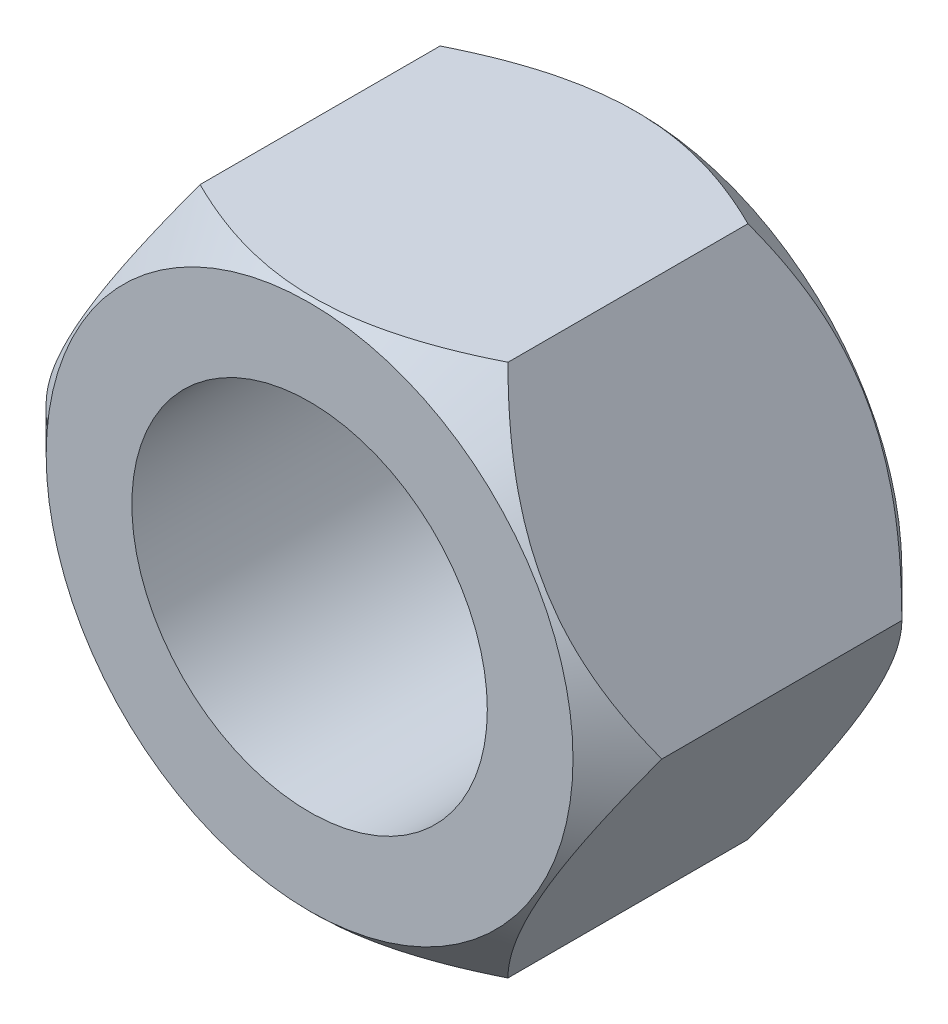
ISO-10303-21;
HEADER;
FILE_DESCRIPTION(('STEP AP214'),'2;1');
FILE_NAME('part.step','',(''),(''),'','','');
FILE_SCHEMA(('AUTOMOTIVE_DESIGN { 1 0 10303 214 1 1 1 1 }'));
ENDSEC;
DATA;
#1=APPLICATION_CONTEXT('core data for automotive mechanical design processes');
#2=APPLICATION_PROTOCOL_DEFINITION('international standard','automotive_design',2000,#1);
#3=PRODUCT_CONTEXT('',#1,'mechanical');
#4=PRODUCT('Part','Part','',(#3));
#5=PRODUCT_RELATED_PRODUCT_CATEGORY('part','',(#4));
#6=PRODUCT_DEFINITION_FORMATION('','',#4);
#7=PRODUCT_DEFINITION_CONTEXT('part definition',#1,'design');
#8=PRODUCT_DEFINITION('design','',#6,#7);
#9=PRODUCT_DEFINITION_SHAPE('','',#8);
#10=(LENGTH_UNIT() NAMED_UNIT(*) SI_UNIT(.MILLI.,.METRE.));
#11=(NAMED_UNIT(*) PLANE_ANGLE_UNIT() SI_UNIT($,.RADIAN.));
#12=(NAMED_UNIT(*) SI_UNIT($,.STERADIAN.) SOLID_ANGLE_UNIT());
#13=UNCERTAINTY_MEASURE_WITH_UNIT(LENGTH_MEASURE(1.E-05),#10,'distance_accuracy_value','');
#14=(GEOMETRIC_REPRESENTATION_CONTEXT(3) GLOBAL_UNCERTAINTY_ASSIGNED_CONTEXT((#13)) GLOBAL_UNIT_ASSIGNED_CONTEXT((#10,
#11,#12)) REPRESENTATION_CONTEXT('',''));
#15=CARTESIAN_POINT('',(0.,0.,0.));
#16=DIRECTION('',(0.,0.,1.));
#17=DIRECTION('',(1.,0.,0.));
#18=AXIS2_PLACEMENT_3D('',#15,#16,#17);
#19=CARTESIAN_POINT('',(0.,0.,7.4));
#20=DIRECTION('',(0.,0.,1.));
#21=DIRECTION('',(1.,0.,0.));
#22=AXIS2_PLACEMENT_3D('',#19,#20,#21);
#23=PLANE('',#22);
#24=CARTESIAN_POINT('',(0.,0.,7.4));
#25=DIRECTION('',(0.,0.,1.));
#26=DIRECTION('',(1.,0.,0.));
#27=AXIS2_PLACEMENT_3D('',#24,#25,#26);
#28=CIRCLE('',#27,8.);
#29=CARTESIAN_POINT('',(8.,0.,7.4));
#30=VERTEX_POINT('',#29);
#31=EDGE_CURVE('E105',#30,#30,#28,.T.);
#32=ORIENTED_EDGE('',*,*,#31,.F.);
#33=EDGE_LOOP('',(#32));
#34=FACE_BOUND('',#33,.T.);
#35=CARTESIAN_POINT('',(0.,0.,7.4));
#36=DIRECTION('',(0.,0.,1.));
#37=DIRECTION('',(1.,0.,0.));
#38=AXIS2_PLACEMENT_3D('',#35,#36,#37);
#39=CIRCLE('',#38,11.856406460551);
#40=CARTESIAN_POINT('',(11.856406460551,0.,7.4));
#41=VERTEX_POINT('',#40);
#42=EDGE_CURVE('E220',#41,#41,#39,.T.);
#43=ORIENTED_EDGE('',*,*,#42,.T.);
#44=EDGE_LOOP('',(#43));
#45=FACE_BOUND('',#44,.T.);
#46=ADVANCED_FACE('F33',(#34,#45),#23,.T.);
#47=CARTESIAN_POINT('',(0.,0.,-7.4));
#48=DIRECTION('',(0.,0.,1.));
#49=DIRECTION('',(1.,0.,0.));
#50=AXIS2_PLACEMENT_3D('',#47,#48,#49);
#51=PLANE('',#50);
#52=CARTESIAN_POINT('',(0.,0.,-7.4));
#53=DIRECTION('',(0.,0.,1.));
#54=DIRECTION('',(1.,0.,0.));
#55=AXIS2_PLACEMENT_3D('',#52,#53,#54);
#56=CIRCLE('',#55,8.);
#57=CARTESIAN_POINT('',(8.,0.,-7.4));
#58=VERTEX_POINT('',#57);
#59=EDGE_CURVE('E109',#58,#58,#56,.T.);
#60=ORIENTED_EDGE('',*,*,#59,.T.);
#61=EDGE_LOOP('',(#60));
#62=FACE_BOUND('',#61,.T.);
#63=CARTESIAN_POINT('',(0.,0.,-7.4));
#64=DIRECTION('',(0.,0.,1.));
#65=DIRECTION('',(1.,0.,0.));
#66=AXIS2_PLACEMENT_3D('',#63,#64,#65);
#67=CIRCLE('',#66,11.856406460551);
#68=CARTESIAN_POINT('',(11.856406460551,0.,-7.4));
#69=VERTEX_POINT('',#68);
#70=EDGE_CURVE('E92',#69,#69,#67,.T.);
#71=ORIENTED_EDGE('',*,*,#70,.F.);
#72=EDGE_LOOP('',(#71));
#73=FACE_BOUND('',#72,.T.);
#74=ADVANCED_FACE('F208',(#62,#73),#51,.F.);
#75=CARTESIAN_POINT('',(6.92820323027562,-11.9999999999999,7.4));
#76=DIRECTION('',(-0.866025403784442,0.499999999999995,0.));
#77=DIRECTION('',(-0.499999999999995,-0.866025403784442,0.));
#78=AXIS2_PLACEMENT_3D('',#75,#76,#77);
#79=PLANE('',#78);
#80=DIRECTION('',(0.,0.,-1.));
#81=VECTOR('',#80,1.);
#82=CARTESIAN_POINT('',(13.856406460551,0.,7.4));
#83=LINE('',#82,#81);
#84=CARTESIAN_POINT('',(13.856406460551,0.,5.4));
#85=VERTEX_POINT('',#84);
#86=CARTESIAN_POINT('',(13.856406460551,0.,-5.4));
#87=VERTEX_POINT('',#86);
#88=EDGE_CURVE('E11',#85,#87,#83,.T.);
#89=ORIENTED_EDGE('',*,*,#88,.F.);
#90=CARTESIAN_POINT('',(13.8565219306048,0.0002,5.3998845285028));
#91=CARTESIAN_POINT('',(13.7374109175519,-0.206106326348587,5.51897795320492));
#92=CARTESIAN_POINT('',(13.6173670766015,-0.414028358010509,5.63443727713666));
#93=CARTESIAN_POINT('',(13.3752685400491,-0.833355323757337,5.85693335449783));
#94=CARTESIAN_POINT('',(13.2532127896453,-1.04476208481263,5.96396550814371));
#95=CARTESIAN_POINT('',(13.006369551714,-1.47230711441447,6.16890615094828));
#96=CARTESIAN_POINT('',(12.8815704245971,-1.6884655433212,6.26675889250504));
#97=CARTESIAN_POINT('',(12.6299224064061,-2.12433269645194,6.45121545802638));
#98=CARTESIAN_POINT('',(12.5030738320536,-2.3440408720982,6.53782100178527));
#99=CARTESIAN_POINT('',(12.2493664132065,-2.78347501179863,6.69704298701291));
#100=CARTESIAN_POINT('',(12.1225387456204,-3.0031469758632,6.76985699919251));
#101=CARTESIAN_POINT('',(11.8671055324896,-3.4455702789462,6.90168005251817));
#102=CARTESIAN_POINT('',(11.7385001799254,-3.66832128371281,6.960690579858));
#103=CARTESIAN_POINT('',(11.480061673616,-4.11594990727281,7.06342102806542));
#104=CARTESIAN_POINT('',(11.3502319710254,-4.34082154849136,7.10717536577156));
#105=CARTESIAN_POINT('',(11.0894826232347,-4.79245266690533,7.17843200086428));
#106=CARTESIAN_POINT('',(10.9585631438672,-5.01921185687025,7.20593672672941));
#107=CARTESIAN_POINT('',(10.6395223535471,-5.57180671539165,7.25205450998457));
#108=CARTESIAN_POINT('',(10.4510562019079,-5.89823966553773,7.2617321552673));
#109=CARTESIAN_POINT('',(10.0744647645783,-6.55051516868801,7.24548750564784));
#110=CARTESIAN_POINT('',(9.88633962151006,-6.87635747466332,7.21955273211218));
#111=CARTESIAN_POINT('',(9.5118627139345,-7.52497050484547,7.13361406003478));
#112=CARTESIAN_POINT('',(9.32551316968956,-7.84773738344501,7.07357206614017));
#113=CARTESIAN_POINT('',(8.95601707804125,-8.48772338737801,6.92268263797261));
#114=CARTESIAN_POINT('',(8.77287028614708,-8.80494293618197,6.83183756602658));
#115=CARTESIAN_POINT('',(8.44776278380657,-9.36804564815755,6.6449480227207));
#116=CARTESIAN_POINT('',(8.30508197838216,-9.6151760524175,6.55382004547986));
#117=CARTESIAN_POINT('',(8.02228146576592,-10.1050009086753,6.35688014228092));
#118=CARTESIAN_POINT('',(7.88216183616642,-10.3476952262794,6.25106777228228));
#119=CARTESIAN_POINT('',(7.60492501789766,-10.8278834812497,6.02713074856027));
#120=CARTESIAN_POINT('',(7.46779994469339,-11.065391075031,5.9090448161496));
#121=CARTESIAN_POINT('',(7.19608877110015,-11.5360086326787,5.66211075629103));
#122=CARTESIAN_POINT('',(7.06150117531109,-11.7691211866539,5.53326922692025));
#123=CARTESIAN_POINT('',(6.92808776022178,-12.0001999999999,5.3998845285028));
#124=B_SPLINE_CURVE_WITH_KNOTS('',3,(#90,#91,#92,#93,#94,#95,#96,#97,#98,#99,#100,#101,#102,
#103,#104,#105,#106,#107,#108,#109,#110,#111,#112,#113,#114,#115,#116,#117,#118,#119,#120,#121,
#122,#123),.UNSPECIFIED.,.F.,.F.,(4,2,2,2,2,2,2,2,2,2,2,2,2,2,2,2,4),(0.,0.79903119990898,
1.59849555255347,2.40253734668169,3.20645605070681,3.99780391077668,4.7890665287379,
5.57853238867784,6.36788023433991,7.49728680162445,8.62708921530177,9.75815602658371,
10.8891361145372,11.7873913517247,12.6856737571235,13.5812036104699,14.4761880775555),.UNSPECIFIED.);
#125=CARTESIAN_POINT('',(6.92820323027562,-11.9999999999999,5.4));
#126=VERTEX_POINT('',#125);
#127=EDGE_CURVE('E85',#85,#126,#124,.T.);
#128=ORIENTED_EDGE('',*,*,#127,.T.);
#129=DIRECTION('',(0.,0.,-1.));
#130=VECTOR('',#129,1.);
#131=CARTESIAN_POINT('',(6.92820323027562,-11.9999999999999,7.4));
#132=LINE('',#131,#130);
#133=CARTESIAN_POINT('',(6.92820323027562,-11.9999999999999,-5.4));
#134=VERTEX_POINT('',#133);
#135=EDGE_CURVE('E57',#126,#134,#132,.T.);
#136=ORIENTED_EDGE('',*,*,#135,.T.);
#137=CARTESIAN_POINT('',(6.92808776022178,-12.0001999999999,-5.3998845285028));
#138=CARTESIAN_POINT('',(7.04719877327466,-11.7938936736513,-5.51897795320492));
#139=CARTESIAN_POINT('',(7.16724261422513,-11.5859716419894,-5.63443727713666));
#140=CARTESIAN_POINT('',(7.40934115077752,-11.1666446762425,-5.85693335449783));
#141=CARTESIAN_POINT('',(7.5313969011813,-10.9552379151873,-5.96396550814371));
#142=CARTESIAN_POINT('',(7.77824013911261,-10.5276928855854,-6.16890615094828));
#143=CARTESIAN_POINT('',(7.90303926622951,-10.3115344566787,-6.26675889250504));
#144=CARTESIAN_POINT('',(8.15468728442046,-9.87566730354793,-6.45121545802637));
#145=CARTESIAN_POINT('',(8.28153585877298,-9.65595912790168,-6.53782100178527));
#146=CARTESIAN_POINT('',(8.53524327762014,-9.21652498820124,-6.69704298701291));
#147=CARTESIAN_POINT('',(8.66207094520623,-8.99685302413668,-6.76985699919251));
#148=CARTESIAN_POINT('',(8.91750415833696,-8.55442972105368,-6.90168005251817));
#149=CARTESIAN_POINT('',(9.04610951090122,-8.33167871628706,-6.960690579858));
#150=CARTESIAN_POINT('',(9.30454801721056,-7.88405009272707,-7.06342102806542));
#151=CARTESIAN_POINT('',(9.4343777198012,-7.65917845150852,-7.10717536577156));
#152=CARTESIAN_POINT('',(9.69512706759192,-7.20754733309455,-7.17843200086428));
#153=CARTESIAN_POINT('',(9.82604654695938,-6.98078814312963,-7.20593672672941));
#154=CARTESIAN_POINT('',(10.1450873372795,-6.42819328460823,-7.25205450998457));
#155=CARTESIAN_POINT('',(10.3335534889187,-6.10176033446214,-7.2617321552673));
#156=CARTESIAN_POINT('',(10.7101449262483,-5.44948483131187,-7.24548750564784));
#157=CARTESIAN_POINT('',(10.8982700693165,-5.12364252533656,-7.21955273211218));
#158=CARTESIAN_POINT('',(11.2727469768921,-4.47502949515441,-7.13361406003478));
#159=CARTESIAN_POINT('',(11.459096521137,-4.15226261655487,-7.07357206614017));
#160=CARTESIAN_POINT('',(11.8285926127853,-3.51227661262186,-6.92268263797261));
#161=CARTESIAN_POINT('',(12.0117394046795,-3.19505706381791,-6.83183756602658));
#162=CARTESIAN_POINT('',(12.33684690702,-2.63195435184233,-6.6449480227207));
#163=CARTESIAN_POINT('',(12.4795277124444,-2.38482394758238,-6.55382004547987));
#164=CARTESIAN_POINT('',(12.7623282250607,-1.89499909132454,-6.35688014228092));
#165=CARTESIAN_POINT('',(12.9024478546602,-1.65230477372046,-6.25106777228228));
#166=CARTESIAN_POINT('',(13.1796846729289,-1.17211651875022,-6.02713074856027));
#167=CARTESIAN_POINT('',(13.3168097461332,-0.934608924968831,-5.9090448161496));
#168=CARTESIAN_POINT('',(13.5885209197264,-0.463991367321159,-5.66211075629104));
#169=CARTESIAN_POINT('',(13.7231085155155,-0.23087881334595,-5.53326922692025));
#170=CARTESIAN_POINT('',(13.8565219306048,0.000200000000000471,-5.3998845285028));
#171=B_SPLINE_CURVE_WITH_KNOTS('',3,(#137,#138,#139,#140,#141,#142,#143,#144,#145,#146,#147,
#148,#149,#150,#151,#152,#153,#154,#155,#156,#157,#158,#159,#160,#161,#162,#163,#164,#165,#166,
#167,#168,#169,#170),.UNSPECIFIED.,.F.,.F.,(4,2,2,2,2,2,2,2,2,2,2,2,2,2,2,2,4),(0.,
0.799031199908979,1.59849555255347,2.40253734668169,3.2064560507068,3.99780391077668,
4.7890665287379,5.57853238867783,6.36788023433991,7.49728680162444,8.62708921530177,
9.75815602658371,10.8891361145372,11.7873913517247,12.6856737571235,13.5812036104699,
14.4761880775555),.UNSPECIFIED.);
#172=EDGE_CURVE('E101',#134,#87,#171,.T.);
#173=ORIENTED_EDGE('',*,*,#172,.T.);
#174=EDGE_LOOP('',(#89,#128,#136,#173));
#175=FACE_BOUND('',#174,.T.);
#176=ADVANCED_FACE('F35',(#175),#79,.F.);
#177=CARTESIAN_POINT('',(13.856406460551,0.,7.4));
#178=DIRECTION('',(-0.866025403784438,-0.500000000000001,0.));
#179=DIRECTION('',(0.500000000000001,-0.866025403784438,0.));
#180=AXIS2_PLACEMENT_3D('',#177,#178,#179);
#181=PLANE('',#180);
#182=DIRECTION('',(0.,0.,-1.));
#183=VECTOR('',#182,1.);
#184=CARTESIAN_POINT('',(6.92820323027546,12.,7.4));
#185=LINE('',#184,#183);
#186=CARTESIAN_POINT('',(6.92820323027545,12.,5.4));
#187=VERTEX_POINT('',#186);
#188=CARTESIAN_POINT('',(6.92820323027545,12.,-5.4));
#189=VERTEX_POINT('',#188);
#190=EDGE_CURVE('E42',#187,#189,#185,.T.);
#191=ORIENTED_EDGE('',*,*,#190,.F.);
#192=CARTESIAN_POINT('',(6.92808776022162,12.0002,5.3998845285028));
#193=CARTESIAN_POINT('',(7.0471987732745,11.7938936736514,5.51897795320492));
#194=CARTESIAN_POINT('',(7.16724261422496,11.5859716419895,5.63443727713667));
#195=CARTESIAN_POINT('',(7.40934115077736,11.1666446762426,5.85693335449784));
#196=CARTESIAN_POINT('',(7.53139690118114,10.9552379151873,5.96396550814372));
#197=CARTESIAN_POINT('',(7.77824013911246,10.5276928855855,6.1689061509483));
#198=CARTESIAN_POINT('',(7.90303926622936,10.3115344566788,6.26675889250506));
#199=CARTESIAN_POINT('',(8.15468728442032,9.87566730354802,6.4512154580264));
#200=CARTESIAN_POINT('',(8.28153585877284,9.65595912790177,6.5378210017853));
#201=CARTESIAN_POINT('',(8.53524327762,9.21652498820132,6.69704298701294));
#202=CARTESIAN_POINT('',(8.6620709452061,8.99685302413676,6.76985699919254));
#203=CARTESIAN_POINT('',(8.91750415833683,8.55442972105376,6.90168005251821));
#204=CARTESIAN_POINT('',(9.0461095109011,8.33167871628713,6.96069057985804));
#205=CARTESIAN_POINT('',(9.30454801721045,7.88405009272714,7.06342102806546));
#206=CARTESIAN_POINT('',(9.43437771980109,7.65917845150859,7.1071753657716));
#207=CARTESIAN_POINT('',(9.69512706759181,7.20754733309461,7.17843200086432));
#208=CARTESIAN_POINT('',(9.82604654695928,6.98078814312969,7.20593672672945));
#209=CARTESIAN_POINT('',(10.1450873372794,6.42819328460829,7.25205450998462));
#210=CARTESIAN_POINT('',(10.3335534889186,6.10176033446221,7.26173215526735));
#211=CARTESIAN_POINT('',(10.7101449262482,5.44948483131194,7.24548750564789));
#212=CARTESIAN_POINT('',(10.8982700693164,5.12364252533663,7.21955273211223));
#213=CARTESIAN_POINT('',(11.272746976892,4.47502949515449,7.13361406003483));
#214=CARTESIAN_POINT('',(11.4590965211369,4.15226261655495,7.07357206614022));
#215=CARTESIAN_POINT('',(11.8285926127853,3.51227661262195,6.92268263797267));
#216=CARTESIAN_POINT('',(12.0117394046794,3.19505706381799,6.83183756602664));
#217=CARTESIAN_POINT('',(12.3368469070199,2.63195435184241,6.64494802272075));
#218=CARTESIAN_POINT('',(12.4795277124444,2.38482394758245,6.55382004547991));
#219=CARTESIAN_POINT('',(12.7623282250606,1.89499909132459,6.35688014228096));
#220=CARTESIAN_POINT('',(12.9024478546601,1.65230477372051,6.25106777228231));
#221=CARTESIAN_POINT('',(13.1796846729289,1.17211651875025,6.0271307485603));
#222=CARTESIAN_POINT('',(13.3168097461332,0.934608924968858,5.90904481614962));
#223=CARTESIAN_POINT('',(13.5885209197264,0.463991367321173,5.66211075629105));
#224=CARTESIAN_POINT('',(13.7231085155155,0.230878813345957,5.53326922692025));
#225=CARTESIAN_POINT('',(13.8565219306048,-0.000200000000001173,5.3998845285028));
#226=B_SPLINE_CURVE_WITH_KNOTS('',3,(#192,#193,#194,#195,#196,#197,#198,#199,#200,#201,#202,
#203,#204,#205,#206,#207,#208,#209,#210,#211,#212,#213,#214,#215,#216,#217,#218,#219,#220,#221,
#222,#223,#224,#225),.UNSPECIFIED.,.F.,.F.,(4,2,2,2,2,2,2,2,2,2,2,2,2,2,2,2,4),(0.,
0.799031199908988,1.59849555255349,2.40253734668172,3.20645605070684,3.99780391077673,
4.78906652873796,5.57853238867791,6.36788023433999,7.49728680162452,8.62708921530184,
9.75815602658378,10.8891361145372,11.7873913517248,12.6856737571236,13.58120361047,
14.4761880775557),.UNSPECIFIED.);
#227=EDGE_CURVE('E88',#187,#85,#226,.T.);
#228=ORIENTED_EDGE('',*,*,#227,.T.);
#229=ORIENTED_EDGE('',*,*,#88,.T.);
#230=CARTESIAN_POINT('',(13.8565219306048,-0.0002,-5.3998845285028));
#231=CARTESIAN_POINT('',(13.7374109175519,0.206106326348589,-5.51897795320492));
#232=CARTESIAN_POINT('',(13.6173670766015,0.414028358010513,-5.63443727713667));
#233=CARTESIAN_POINT('',(13.3752685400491,0.833355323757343,-5.85693335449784));
#234=CARTESIAN_POINT('',(13.2532127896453,1.04476208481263,-5.96396550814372));
#235=CARTESIAN_POINT('',(13.006369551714,1.47230711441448,-6.1689061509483));
#236=CARTESIAN_POINT('',(12.8815704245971,1.68846554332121,-6.26675889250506));
#237=CARTESIAN_POINT('',(12.6299224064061,2.12433269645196,-6.4512154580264));
#238=CARTESIAN_POINT('',(12.5030738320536,2.34404087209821,-6.5378210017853));
#239=CARTESIAN_POINT('',(12.2493664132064,2.78347501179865,-6.69704298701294));
#240=CARTESIAN_POINT('',(12.1225387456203,3.00314697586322,-6.76985699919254));
#241=CARTESIAN_POINT('',(11.8671055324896,3.44557027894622,-6.90168005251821));
#242=CARTESIAN_POINT('',(11.7385001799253,3.66832128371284,-6.96069057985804));
#243=CARTESIAN_POINT('',(11.480061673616,4.11594990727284,-7.06342102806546));
#244=CARTESIAN_POINT('',(11.3502319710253,4.34082154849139,-7.1071753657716));
#245=CARTESIAN_POINT('',(11.0894826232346,4.79245266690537,-7.17843200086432));
#246=CARTESIAN_POINT('',(10.9585631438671,5.01921185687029,-7.20593672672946));
#247=CARTESIAN_POINT('',(10.639522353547,5.57180671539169,-7.25205450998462));
#248=CARTESIAN_POINT('',(10.4510562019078,5.89823966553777,-7.26173215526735));
#249=CARTESIAN_POINT('',(10.0744647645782,6.55051516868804,-7.24548750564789));
#250=CARTESIAN_POINT('',(9.88633962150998,6.87635747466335,-7.21955273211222));
#251=CARTESIAN_POINT('',(9.51186271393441,7.5249705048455,-7.13361406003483));
#252=CARTESIAN_POINT('',(9.32551316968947,7.84773738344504,-7.07357206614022));
#253=CARTESIAN_POINT('',(8.95601707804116,8.48772338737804,-6.92268263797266));
#254=CARTESIAN_POINT('',(8.77287028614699,8.80494293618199,-6.83183756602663));
#255=CARTESIAN_POINT('',(8.44776278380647,9.36804564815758,-6.64494802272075));
#256=CARTESIAN_POINT('',(8.30508197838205,9.61517605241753,-6.55382004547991));
#257=CARTESIAN_POINT('',(8.0222814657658,10.1050009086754,-6.35688014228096));
#258=CARTESIAN_POINT('',(7.88216183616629,10.3476952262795,-6.25106777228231));
#259=CARTESIAN_POINT('',(7.60492501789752,10.8278834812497,-6.0271307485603));
#260=CARTESIAN_POINT('',(7.46779994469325,11.0653910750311,-5.90904481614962));
#261=CARTESIAN_POINT('',(7.1960887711,11.5360086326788,-5.66211075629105));
#262=CARTESIAN_POINT('',(7.06150117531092,11.769121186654,-5.53326922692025));
#263=CARTESIAN_POINT('',(6.92808776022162,12.0002,-5.3998845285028));
#264=B_SPLINE_CURVE_WITH_KNOTS('',3,(#230,#231,#232,#233,#234,#235,#236,#237,#238,#239,#240,
#241,#242,#243,#244,#245,#246,#247,#248,#249,#250,#251,#252,#253,#254,#255,#256,#257,#258,#259,
#260,#261,#262,#263),.UNSPECIFIED.,.F.,.F.,(4,2,2,2,2,2,2,2,2,2,2,2,2,2,2,2,4),(0.,
0.79903119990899,1.59849555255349,2.40253734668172,3.20645605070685,3.99780391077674,
4.78906652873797,5.57853238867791,6.36788023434,7.49728680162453,8.62708921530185,
9.75815602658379,10.8891361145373,11.7873913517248,12.6856737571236,13.58120361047,
14.4761880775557),.UNSPECIFIED.);
#265=EDGE_CURVE('E106',#87,#189,#264,.T.);
#266=ORIENTED_EDGE('',*,*,#265,.T.);
#267=EDGE_LOOP('',(#191,#228,#229,#266));
#268=FACE_BOUND('',#267,.T.);
#269=ADVANCED_FACE('F96',(#268),#181,.F.);
#270=CARTESIAN_POINT('',(6.92820323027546,12.,7.4));
#271=DIRECTION('',(0.,-1.,0.));
#272=DIRECTION('',(1.,0.,0.));
#273=AXIS2_PLACEMENT_3D('',#270,#271,#272);
#274=PLANE('',#273);
#275=DIRECTION('',(0.,0.,-1.));
#276=VECTOR('',#275,1.);
#277=CARTESIAN_POINT('',(-6.92820323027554,11.9999999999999,7.4));
#278=LINE('',#277,#276);
#279=CARTESIAN_POINT('',(-6.92820323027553,11.9999999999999,5.4));
#280=VERTEX_POINT('',#279);
#281=CARTESIAN_POINT('',(-6.92820323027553,11.9999999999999,-5.4));
#282=VERTEX_POINT('',#281);
#283=EDGE_CURVE('E198',#280,#282,#278,.T.);
#284=ORIENTED_EDGE('',*,*,#283,.F.);
#285=CARTESIAN_POINT('',(-14.4006888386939,11.9999999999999,0.511278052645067));
#286=CARTESIAN_POINT('',(-14.0525506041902,11.9999999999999,0.778670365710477));
#287=CARTESIAN_POINT('',(-13.702529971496,11.9999999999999,1.04365047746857));
#288=CARTESIAN_POINT('',(-12.9979568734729,11.9999999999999,1.56768618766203));
#289=CARTESIAN_POINT('',(-12.6434033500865,11.9999999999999,1.82674036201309));
#290=CARTESIAN_POINT('',(-11.9264058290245,11.9999999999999,2.33966777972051));
#291=CARTESIAN_POINT('',(-11.563922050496,11.9999999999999,2.59348559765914));
#292=CARTESIAN_POINT('',(-10.8329104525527,11.9999999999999,3.09223323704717));
#293=CARTESIAN_POINT('',(-10.4643830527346,11.9999999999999,3.33716367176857));
#294=CARTESIAN_POINT('',(-9.69689227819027,11.9999999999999,3.83116495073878));
#295=CARTESIAN_POINT('',(-9.29747155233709,11.9999999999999,4.07952881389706));
#296=CARTESIAN_POINT('',(-8.48925422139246,11.9999999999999,4.56076138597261));
#297=CARTESIAN_POINT('',(-8.08045606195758,11.9999999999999,4.79362750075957));
#298=CARTESIAN_POINT('',(-7.25338535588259,11.9999999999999,5.2388994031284));
#299=CARTESIAN_POINT('',(-6.83514540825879,11.9999999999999,5.45136526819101));
#300=CARTESIAN_POINT('',(-5.98687825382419,11.9999999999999,5.85107663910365));
#301=CARTESIAN_POINT('',(-5.55685670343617,11.9999999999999,6.03833400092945));
#302=CARTESIAN_POINT('',(-4.72649804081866,11.9999999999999,6.36421579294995));
#303=CARTESIAN_POINT('',(-4.32733328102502,11.9999999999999,6.50579700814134));
#304=CARTESIAN_POINT('',(-3.51888368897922,11.9999999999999,6.75700362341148));
#305=CARTESIAN_POINT('',(-3.10959820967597,11.9999999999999,6.86662697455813));
#306=CARTESIAN_POINT('',(-2.29045033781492,11.9999999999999,7.04617663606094));
#307=CARTESIAN_POINT('',(-1.88074784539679,11.9999999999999,7.11682022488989));
#308=CARTESIAN_POINT('',(-1.05631578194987,11.9999999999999,7.21694510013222));
#309=CARTESIAN_POINT('',(-0.641587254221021,11.9999999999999,7.24643478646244));
#310=CARTESIAN_POINT('',(0.170838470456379,11.9999999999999,7.26176834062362));
#311=CARTESIAN_POINT('',(0.568501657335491,12.,7.24943340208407));
#312=CARTESIAN_POINT('',(1.36069882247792,12.,7.18596656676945));
#313=CARTESIAN_POINT('',(1.75523251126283,12.,7.13483112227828));
#314=CARTESIAN_POINT('',(2.54499979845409,12.,6.99577632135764));
#315=CARTESIAN_POINT('',(2.94011749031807,12.,6.90720967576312));
#316=CARTESIAN_POINT('',(3.72166087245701,12.,6.69818886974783));
#317=CARTESIAN_POINT('',(4.10808707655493,12.,6.57773659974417));
#318=CARTESIAN_POINT('',(4.89467698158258,12.,6.30210385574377));
#319=CARTESIAN_POINT('',(5.29425095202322,12.,6.14525929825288));
#320=CARTESIAN_POINT('',(6.0831137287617,12.,5.80734980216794));
#321=CARTESIAN_POINT('',(6.47239778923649,12.,5.62627391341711));
#322=CARTESIAN_POINT('',(7.24252407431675,12.,5.24419683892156));
#323=CARTESIAN_POINT('',(7.62333555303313,12.,5.04313418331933));
#324=CARTESIAN_POINT('',(8.37622961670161,12.,4.62550973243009));
#325=CARTESIAN_POINT('',(8.74831353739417,12.,4.4089503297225));
#326=CARTESIAN_POINT('',(9.46670058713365,12.,3.97436664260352));
#327=CARTESIAN_POINT('',(9.81336920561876,12.,3.75694333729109));
#328=CARTESIAN_POINT('',(10.5007506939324,12.,3.31285021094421));
#329=CARTESIAN_POINT('',(10.8414631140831,12.,3.0861796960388));
#330=CARTESIAN_POINT('',(11.5149702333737,12.,2.62708887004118));
#331=CARTESIAN_POINT('',(11.8478065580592,12.,2.39472940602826));
#332=CARTESIAN_POINT('',(12.5089143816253,12.,1.92378787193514));
#333=CARTESIAN_POINT('',(12.8371871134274,12.,1.6852075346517));
#334=CARTESIAN_POINT('',(13.1635457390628,12.,1.44408105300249));
#335=B_SPLINE_CURVE_WITH_KNOTS('',3,(#285,#286,#287,#288,#289,#290,#291,#292,#293,#294,#295,
#296,#297,#298,#299,#300,#301,#302,#303,#304,#305,#306,#307,#308,#309,#310,#311,#312,#313,#314,
#315,#316,#317,#318,#319,#320,#321,#322,#323,#324,#325,#326,#327,#328,#329,#330,#331,#332,#333,
#334),.UNSPECIFIED.,.F.,.F.,(4,2,2,2,2,2,2,2,2,2,2,2,2,2,2,2,2,2,2,2,2,2,2,2,4),(0.,
1.31694874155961,2.63421070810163,3.96164041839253,5.28897835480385,6.69972456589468,
8.11070632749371,9.51739647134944,10.9234226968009,12.19291615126,13.4624909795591,
14.7078506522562,15.9529560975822,17.1445538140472,18.3362604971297,19.5494774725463,
20.7626225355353,22.0493986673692,23.336758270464,24.6282074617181,25.9194576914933,
27.1469127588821,28.3744600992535,29.5921423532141,30.8094889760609),.UNSPECIFIED.);
#336=EDGE_CURVE('E99',#280,#187,#335,.T.);
#337=ORIENTED_EDGE('',*,*,#336,.T.);
#338=ORIENTED_EDGE('',*,*,#190,.T.);
#339=CARTESIAN_POINT('',(-14.4006888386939,11.9999999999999,-0.511278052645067));
#340=CARTESIAN_POINT('',(-14.0525506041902,11.9999999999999,-0.778670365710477));
#341=CARTESIAN_POINT('',(-13.702529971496,11.9999999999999,-1.04365047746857));
#342=CARTESIAN_POINT('',(-12.9979568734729,11.9999999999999,-1.56768618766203));
#343=CARTESIAN_POINT('',(-12.6434033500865,11.9999999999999,-1.82674036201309));
#344=CARTESIAN_POINT('',(-11.9264058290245,11.9999999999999,-2.33966777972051));
#345=CARTESIAN_POINT('',(-11.563922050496,11.9999999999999,-2.59348559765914));
#346=CARTESIAN_POINT('',(-10.8329104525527,11.9999999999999,-3.09223323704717));
#347=CARTESIAN_POINT('',(-10.4643830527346,11.9999999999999,-3.33716367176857));
#348=CARTESIAN_POINT('',(-9.69689227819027,11.9999999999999,-3.83116495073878));
#349=CARTESIAN_POINT('',(-9.29747155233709,11.9999999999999,-4.07952881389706));
#350=CARTESIAN_POINT('',(-8.48925422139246,11.9999999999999,-4.56076138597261));
#351=CARTESIAN_POINT('',(-8.08045606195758,11.9999999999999,-4.79362750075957));
#352=CARTESIAN_POINT('',(-7.25338535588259,11.9999999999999,-5.2388994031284));
#353=CARTESIAN_POINT('',(-6.83514540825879,11.9999999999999,-5.45136526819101));
#354=CARTESIAN_POINT('',(-5.98687825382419,11.9999999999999,-5.85107663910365));
#355=CARTESIAN_POINT('',(-5.55685670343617,11.9999999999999,-6.03833400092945));
#356=CARTESIAN_POINT('',(-4.72649804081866,11.9999999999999,-6.36421579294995));
#357=CARTESIAN_POINT('',(-4.32733328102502,11.9999999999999,-6.50579700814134));
#358=CARTESIAN_POINT('',(-3.51888368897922,11.9999999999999,-6.75700362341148));
#359=CARTESIAN_POINT('',(-3.10959820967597,11.9999999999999,-6.86662697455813));
#360=CARTESIAN_POINT('',(-2.29045033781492,11.9999999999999,-7.04617663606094));
#361=CARTESIAN_POINT('',(-1.88074784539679,11.9999999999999,-7.11682022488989));
#362=CARTESIAN_POINT('',(-1.05631578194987,11.9999999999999,-7.21694510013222));
#363=CARTESIAN_POINT('',(-0.641587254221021,11.9999999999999,-7.24643478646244));
#364=CARTESIAN_POINT('',(0.170838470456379,11.9999999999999,-7.26176834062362));
#365=CARTESIAN_POINT('',(0.568501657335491,12.,-7.24943340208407));
#366=CARTESIAN_POINT('',(1.36069882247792,12.,-7.18596656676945));
#367=CARTESIAN_POINT('',(1.75523251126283,12.,-7.13483112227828));
#368=CARTESIAN_POINT('',(2.54499979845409,12.,-6.99577632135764));
#369=CARTESIAN_POINT('',(2.94011749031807,12.,-6.90720967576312));
#370=CARTESIAN_POINT('',(3.72166087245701,12.,-6.69818886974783));
#371=CARTESIAN_POINT('',(4.10808707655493,12.,-6.57773659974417));
#372=CARTESIAN_POINT('',(4.89467698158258,12.,-6.30210385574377));
#373=CARTESIAN_POINT('',(5.29425095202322,12.,-6.14525929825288));
#374=CARTESIAN_POINT('',(6.0831137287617,12.,-5.80734980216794));
#375=CARTESIAN_POINT('',(6.47239778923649,12.,-5.62627391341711));
#376=CARTESIAN_POINT('',(7.24252407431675,12.,-5.24419683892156));
#377=CARTESIAN_POINT('',(7.62333555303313,12.,-5.04313418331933));
#378=CARTESIAN_POINT('',(8.37622961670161,12.,-4.62550973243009));
#379=CARTESIAN_POINT('',(8.74831353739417,12.,-4.4089503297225));
#380=CARTESIAN_POINT('',(9.46670058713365,12.,-3.97436664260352));
#381=CARTESIAN_POINT('',(9.81336920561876,12.,-3.75694333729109));
#382=CARTESIAN_POINT('',(10.5007506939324,12.,-3.31285021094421));
#383=CARTESIAN_POINT('',(10.8414631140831,12.,-3.0861796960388));
#384=CARTESIAN_POINT('',(11.5149702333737,12.,-2.62708887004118));
#385=CARTESIAN_POINT('',(11.8478065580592,12.,-2.39472940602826));
#386=CARTESIAN_POINT('',(12.5089143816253,12.,-1.92378787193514));
#387=CARTESIAN_POINT('',(12.8371871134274,12.,-1.6852075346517));
#388=CARTESIAN_POINT('',(13.1635457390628,12.,-1.44408105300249));
#389=B_SPLINE_CURVE_WITH_KNOTS('',3,(#339,#340,#341,#342,#343,#344,#345,#346,#347,#348,#349,
#350,#351,#352,#353,#354,#355,#356,#357,#358,#359,#360,#361,#362,#363,#364,#365,#366,#367,#368,
#369,#370,#371,#372,#373,#374,#375,#376,#377,#378,#379,#380,#381,#382,#383,#384,#385,#386,#387,
#388),.UNSPECIFIED.,.F.,.F.,(4,2,2,2,2,2,2,2,2,2,2,2,2,2,2,2,2,2,2,2,2,2,2,2,4),(0.,
1.31694874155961,2.63421070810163,3.96164041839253,5.28897835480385,6.69972456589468,
8.11070632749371,9.51739647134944,10.9234226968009,12.19291615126,13.4624909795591,
14.7078506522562,15.9529560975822,17.1445538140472,18.3362604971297,19.5494774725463,
20.7626225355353,22.0493986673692,23.336758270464,24.6282074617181,25.9194576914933,
27.1469127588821,28.3744600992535,29.5921423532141,30.8094889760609),.UNSPECIFIED.);
#390=EDGE_CURVE('E111',#189,#282,#389,.F.);
#391=ORIENTED_EDGE('',*,*,#390,.T.);
#392=EDGE_LOOP('',(#284,#337,#338,#391));
#393=FACE_BOUND('',#392,.T.);
#394=ADVANCED_FACE('F160',(#393),#274,.F.);
#395=CARTESIAN_POINT('',(-6.92820323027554,11.9999999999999,7.4));
#396=DIRECTION('',(0.866025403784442,-0.499999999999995,0.));
#397=DIRECTION('',(0.499999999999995,0.866025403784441,0.));
#398=AXIS2_PLACEMENT_3D('',#395,#396,#397);
#399=PLANE('',#398);
#400=DIRECTION('',(0.,0.,-1.));
#401=VECTOR('',#400,1.);
#402=CARTESIAN_POINT('',(-13.856406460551,0.,7.4));
#403=LINE('',#402,#401);
#404=CARTESIAN_POINT('',(-13.856406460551,0.,5.4));
#405=VERTEX_POINT('',#404);
#406=CARTESIAN_POINT('',(-13.856406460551,0.,-5.4));
#407=VERTEX_POINT('',#406);
#408=EDGE_CURVE('E196',#405,#407,#403,.T.);
#409=ORIENTED_EDGE('',*,*,#408,.F.);
#410=CARTESIAN_POINT('',(-13.8565219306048,-0.000200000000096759,5.3998845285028));
#411=CARTESIAN_POINT('',(-13.7374109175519,0.206106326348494,5.51897795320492));
#412=CARTESIAN_POINT('',(-13.6173670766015,0.414028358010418,5.63443727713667));
#413=CARTESIAN_POINT('',(-13.3752685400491,0.833355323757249,5.85693335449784));
#414=CARTESIAN_POINT('',(-13.2532127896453,1.04476208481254,5.96396550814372));
#415=CARTESIAN_POINT('',(-13.006369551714,1.47230711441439,6.1689061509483));
#416=CARTESIAN_POINT('',(-12.8815704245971,1.68846554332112,6.26675889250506));
#417=CARTESIAN_POINT('',(-12.6299224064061,2.12433269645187,6.4512154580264));
#418=CARTESIAN_POINT('',(-12.5030738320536,2.34404087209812,6.5378210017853));
#419=CARTESIAN_POINT('',(-12.2493664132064,2.78347501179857,6.69704298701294));
#420=CARTESIAN_POINT('',(-12.1225387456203,3.00314697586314,6.76985699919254));
#421=CARTESIAN_POINT('',(-11.8671055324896,3.44557027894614,6.90168005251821));
#422=CARTESIAN_POINT('',(-11.7385001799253,3.66832128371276,6.96069057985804));
#423=CARTESIAN_POINT('',(-11.480061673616,4.11594990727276,7.06342102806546));
#424=CARTESIAN_POINT('',(-11.3502319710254,4.34082154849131,7.1071753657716));
#425=CARTESIAN_POINT('',(-11.0894826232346,4.79245266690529,7.17843200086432));
#426=CARTESIAN_POINT('',(-10.9585631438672,5.01921185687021,7.20593672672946));
#427=CARTESIAN_POINT('',(-10.639522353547,5.57180671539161,7.25205450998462));
#428=CARTESIAN_POINT('',(-10.4510562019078,5.8982396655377,7.26173215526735));
#429=CARTESIAN_POINT('',(-10.0744647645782,6.55051516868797,7.24548750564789));
#430=CARTESIAN_POINT('',(-9.88633962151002,6.87635747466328,7.21955273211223));
#431=CARTESIAN_POINT('',(-9.51186271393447,7.52497050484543,7.13361406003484));
#432=CARTESIAN_POINT('',(-9.32551316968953,7.84773738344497,7.07357206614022));
#433=CARTESIAN_POINT('',(-8.95601707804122,8.48772338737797,6.92268263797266));
#434=CARTESIAN_POINT('',(-8.77287028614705,8.80494293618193,6.83183756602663));
#435=CARTESIAN_POINT('',(-8.44776278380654,9.36804564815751,6.64494802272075));
#436=CARTESIAN_POINT('',(-8.30508197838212,9.61517605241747,6.55382004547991));
#437=CARTESIAN_POINT('',(-8.02228146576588,10.1050009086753,6.35688014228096));
#438=CARTESIAN_POINT('',(-7.88216183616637,10.3476952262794,6.25106777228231));
#439=CARTESIAN_POINT('',(-7.6049250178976,10.8278834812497,6.0271307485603));
#440=CARTESIAN_POINT('',(-7.46779994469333,11.0653910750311,5.90904481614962));
#441=CARTESIAN_POINT('',(-7.19608877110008,11.5360086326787,5.66211075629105));
#442=CARTESIAN_POINT('',(-7.06150117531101,11.769121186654,5.53326922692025));
#443=CARTESIAN_POINT('',(-6.9280877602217,12.0001999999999,5.3998845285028));
#444=B_SPLINE_CURVE_WITH_KNOTS('',3,(#410,#411,#412,#413,#414,#415,#416,#417,#418,#419,#420,
#421,#422,#423,#424,#425,#426,#427,#428,#429,#430,#431,#432,#433,#434,#435,#436,#437,#438,#439,
#440,#441,#442,#443),.UNSPECIFIED.,.F.,.F.,(4,2,2,2,2,2,2,2,2,2,2,2,2,2,2,2,4),(0.,
0.799031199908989,1.59849555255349,2.40253734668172,3.20645605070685,3.99780391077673,
4.78906652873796,5.57853238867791,6.36788023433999,7.49728680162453,8.62708921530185,
9.75815602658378,10.8891361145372,11.7873913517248,12.6856737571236,13.58120361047,
14.4761880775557),.UNSPECIFIED.);
#445=EDGE_CURVE('E173',#405,#280,#444,.T.);
#446=ORIENTED_EDGE('',*,*,#445,.T.);
#447=ORIENTED_EDGE('',*,*,#283,.T.);
#448=CARTESIAN_POINT('',(-6.9280877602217,12.0001999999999,-5.3998845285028));
#449=CARTESIAN_POINT('',(-7.04719877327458,11.7938936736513,-5.51897795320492));
#450=CARTESIAN_POINT('',(-7.16724261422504,11.5859716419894,-5.63443727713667));
#451=CARTESIAN_POINT('',(-7.40934115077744,11.1666446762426,-5.85693335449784));
#452=CARTESIAN_POINT('',(-7.53139690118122,10.9552379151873,-5.96396550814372));
#453=CARTESIAN_POINT('',(-7.77824013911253,10.5276928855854,-6.1689061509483));
#454=CARTESIAN_POINT('',(-7.90303926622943,10.3115344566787,-6.26675889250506));
#455=CARTESIAN_POINT('',(-8.15468728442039,9.87566730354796,-6.4512154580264));
#456=CARTESIAN_POINT('',(-8.28153585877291,9.6559591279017,-6.5378210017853));
#457=CARTESIAN_POINT('',(-8.53524327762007,9.21652498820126,-6.69704298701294));
#458=CARTESIAN_POINT('',(-8.66207094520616,8.99685302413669,-6.76985699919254));
#459=CARTESIAN_POINT('',(-8.91750415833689,8.55442972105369,-6.90168005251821));
#460=CARTESIAN_POINT('',(-9.04610951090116,8.33167871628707,-6.96069057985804));
#461=CARTESIAN_POINT('',(-9.3045480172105,7.88405009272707,-7.06342102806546));
#462=CARTESIAN_POINT('',(-9.43437771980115,7.65917845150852,-7.1071753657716));
#463=CARTESIAN_POINT('',(-9.69512706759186,7.20754733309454,-7.17843200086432));
#464=CARTESIAN_POINT('',(-9.82604654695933,6.98078814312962,-7.20593672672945));
#465=CARTESIAN_POINT('',(-10.1450873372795,6.42819328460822,-7.25205450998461));
#466=CARTESIAN_POINT('',(-10.3335534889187,6.10176033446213,-7.26173215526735));
#467=CARTESIAN_POINT('',(-10.7101449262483,5.44948483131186,-7.24548750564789));
#468=CARTESIAN_POINT('',(-10.8982700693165,5.12364252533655,-7.21955273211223));
#469=CARTESIAN_POINT('',(-11.272746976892,4.4750294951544,-7.13361406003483));
#470=CARTESIAN_POINT('',(-11.459096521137,4.15226261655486,-7.07357206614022));
#471=CARTESIAN_POINT('',(-11.8285926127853,3.51227661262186,-6.92268263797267));
#472=CARTESIAN_POINT('',(-12.0117394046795,3.1950570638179,-6.83183756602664));
#473=CARTESIAN_POINT('',(-12.33684690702,2.63195435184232,-6.64494802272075));
#474=CARTESIAN_POINT('',(-12.4795277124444,2.38482394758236,-6.55382004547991));
#475=CARTESIAN_POINT('',(-12.7623282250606,1.8949990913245,-6.35688014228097));
#476=CARTESIAN_POINT('',(-12.9024478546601,1.65230477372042,-6.25106777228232));
#477=CARTESIAN_POINT('',(-13.1796846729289,1.17211651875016,-6.0271307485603));
#478=CARTESIAN_POINT('',(-13.3168097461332,0.934608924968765,-5.90904481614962));
#479=CARTESIAN_POINT('',(-13.5885209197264,0.463991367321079,-5.66211075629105));
#480=CARTESIAN_POINT('',(-13.7231085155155,0.230878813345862,-5.53326922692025));
#481=CARTESIAN_POINT('',(-13.8565219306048,-0.0002000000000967,-5.3998845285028));
#482=B_SPLINE_CURVE_WITH_KNOTS('',3,(#448,#449,#450,#451,#452,#453,#454,#455,#456,#457,#458,
#459,#460,#461,#462,#463,#464,#465,#466,#467,#468,#469,#470,#471,#472,#473,#474,#475,#476,#477,
#478,#479,#480,#481),.UNSPECIFIED.,.F.,.F.,(4,2,2,2,2,2,2,2,2,2,2,2,2,2,2,2,4),(0.,
0.799031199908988,1.59849555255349,2.40253734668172,3.20645605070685,3.99780391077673,
4.78906652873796,5.57853238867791,6.36788023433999,7.49728680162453,8.62708921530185,
9.75815602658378,10.8891361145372,11.7873913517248,12.6856737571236,13.58120361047,
14.4761880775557),.UNSPECIFIED.);
#483=EDGE_CURVE('E150',#282,#407,#482,.T.);
#484=ORIENTED_EDGE('',*,*,#483,.T.);
#485=EDGE_LOOP('',(#409,#446,#447,#484));
#486=FACE_BOUND('',#485,.T.);
#487=ADVANCED_FACE('F163',(#486),#399,.F.);
#488=CARTESIAN_POINT('',(-13.856406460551,0.,7.4));
#489=DIRECTION('',(0.866025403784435,0.500000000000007,0.));
#490=DIRECTION('',(-0.500000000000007,0.866025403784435,0.));
#491=AXIS2_PLACEMENT_3D('',#488,#489,#490);
#492=PLANE('',#491);
#493=DIRECTION('',(0.,0.,-1.));
#494=VECTOR('',#493,1.);
#495=CARTESIAN_POINT('',(-6.92820323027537,-12.,7.4));
#496=LINE('',#495,#494);
#497=CARTESIAN_POINT('',(-6.92820323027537,-12.,5.4));
#498=VERTEX_POINT('',#497);
#499=CARTESIAN_POINT('',(-6.92820323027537,-12.,-5.4));
#500=VERTEX_POINT('',#499);
#501=EDGE_CURVE('E203',#498,#500,#496,.T.);
#502=ORIENTED_EDGE('',*,*,#501,.F.);
#503=CARTESIAN_POINT('',(-6.92808776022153,-12.0002,5.3998845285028));
#504=CARTESIAN_POINT('',(-7.04719877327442,-11.7938936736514,5.51897795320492));
#505=CARTESIAN_POINT('',(-7.16724261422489,-11.5859716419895,5.63443727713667));
#506=CARTESIAN_POINT('',(-7.40934115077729,-11.1666446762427,5.85693335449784));
#507=CARTESIAN_POINT('',(-7.53139690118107,-10.9552379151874,5.96396550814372));
#508=CARTESIAN_POINT('',(-7.77824013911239,-10.5276928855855,6.1689061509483));
#509=CARTESIAN_POINT('',(-7.90303926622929,-10.3115344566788,6.26675889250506));
#510=CARTESIAN_POINT('',(-8.15468728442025,-9.87566730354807,6.4512154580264));
#511=CARTESIAN_POINT('',(-8.28153585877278,-9.65595912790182,6.5378210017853));
#512=CARTESIAN_POINT('',(-8.53524327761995,-9.21652498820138,6.69704298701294));
#513=CARTESIAN_POINT('',(-8.66207094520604,-8.99685302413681,6.76985699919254));
#514=CARTESIAN_POINT('',(-8.91750415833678,-8.55442972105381,6.90168005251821));
#515=CARTESIAN_POINT('',(-9.04610951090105,-8.33167871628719,6.96069057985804));
#516=CARTESIAN_POINT('',(-9.3045480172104,-7.8840500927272,7.06342102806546));
#517=CARTESIAN_POINT('',(-9.43437771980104,-7.65917845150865,7.1071753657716));
#518=CARTESIAN_POINT('',(-9.69512706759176,-7.20754733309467,7.17843200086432));
#519=CARTESIAN_POINT('',(-9.82604654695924,-6.98078814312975,7.20593672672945));
#520=CARTESIAN_POINT('',(-10.1450873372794,-6.42819328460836,7.25205450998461));
#521=CARTESIAN_POINT('',(-10.3335534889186,-6.10176033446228,7.26173215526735));
#522=CARTESIAN_POINT('',(-10.7101449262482,-5.44948483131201,7.24548750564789));
#523=CARTESIAN_POINT('',(-10.8982700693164,-5.1236425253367,7.21955273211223));
#524=CARTESIAN_POINT('',(-11.272746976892,-4.47502949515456,7.13361406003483));
#525=CARTESIAN_POINT('',(-11.4590965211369,-4.15226261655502,7.07357206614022));
#526=CARTESIAN_POINT('',(-11.8285926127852,-3.51227661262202,6.92268263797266));
#527=CARTESIAN_POINT('',(-12.0117394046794,-3.19505706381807,6.83183756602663));
#528=CARTESIAN_POINT('',(-12.3368469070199,-2.63195435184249,6.64494802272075));
#529=CARTESIAN_POINT('',(-12.4795277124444,-2.38482394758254,6.55382004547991));
#530=CARTESIAN_POINT('',(-12.7623282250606,-1.89499909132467,6.35688014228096));
#531=CARTESIAN_POINT('',(-12.9024478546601,-1.65230477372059,6.25106777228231));
#532=CARTESIAN_POINT('',(-13.1796846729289,-1.17211651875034,6.0271307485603));
#533=CARTESIAN_POINT('',(-13.3168097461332,-0.934608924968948,5.90904481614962));
#534=CARTESIAN_POINT('',(-13.5885209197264,-0.463991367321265,5.66211075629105));
#535=CARTESIAN_POINT('',(-13.7231085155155,-0.230878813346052,5.53326922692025));
#536=CARTESIAN_POINT('',(-13.8565219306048,0.000199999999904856,5.3998845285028));
#537=B_SPLINE_CURVE_WITH_KNOTS('',3,(#503,#504,#505,#506,#507,#508,#509,#510,#511,#512,#513,
#514,#515,#516,#517,#518,#519,#520,#521,#522,#523,#524,#525,#526,#527,#528,#529,#530,#531,#532,
#533,#534,#535,#536),.UNSPECIFIED.,.F.,.F.,(4,2,2,2,2,2,2,2,2,2,2,2,2,2,2,2,4),(0.,
0.79903119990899,1.59849555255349,2.40253734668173,3.20645605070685,3.99780391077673,
4.78906652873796,5.57853238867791,6.36788023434,7.49728680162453,8.62708921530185,
9.75815602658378,10.8891361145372,11.7873913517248,12.6856737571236,13.58120361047,
14.4761880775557),.UNSPECIFIED.);
#538=EDGE_CURVE('E49',#498,#405,#537,.T.);
#539=ORIENTED_EDGE('',*,*,#538,.T.);
#540=ORIENTED_EDGE('',*,*,#408,.T.);
#541=CARTESIAN_POINT('',(-13.8565219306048,0.000199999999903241,-5.3998845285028));
#542=CARTESIAN_POINT('',(-13.7374109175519,-0.206106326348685,-5.51897795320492));
#543=CARTESIAN_POINT('',(-13.6173670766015,-0.414028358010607,-5.63443727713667));
#544=CARTESIAN_POINT('',(-13.3752685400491,-0.833355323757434,-5.85693335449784));
#545=CARTESIAN_POINT('',(-13.2532127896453,-1.04476208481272,-5.96396550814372));
#546=CARTESIAN_POINT('',(-13.006369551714,-1.47230711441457,-6.1689061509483));
#547=CARTESIAN_POINT('',(-12.881570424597,-1.68846554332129,-6.26675889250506));
#548=CARTESIAN_POINT('',(-12.6299224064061,-2.12433269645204,-6.4512154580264));
#549=CARTESIAN_POINT('',(-12.5030738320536,-2.3440408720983,-6.5378210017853));
#550=CARTESIAN_POINT('',(-12.2493664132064,-2.78347501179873,-6.69704298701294));
#551=CARTESIAN_POINT('',(-12.1225387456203,-3.0031469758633,-6.76985699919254));
#552=CARTESIAN_POINT('',(-11.8671055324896,-3.4455702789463,-6.90168005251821));
#553=CARTESIAN_POINT('',(-11.7385001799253,-3.66832128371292,-6.96069057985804));
#554=CARTESIAN_POINT('',(-11.4800616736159,-4.11594990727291,-7.06342102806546));
#555=CARTESIAN_POINT('',(-11.3502319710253,-4.34082154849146,-7.1071753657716));
#556=CARTESIAN_POINT('',(-11.0894826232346,-4.79245266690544,-7.17843200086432));
#557=CARTESIAN_POINT('',(-10.9585631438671,-5.01921185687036,-7.20593672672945));
#558=CARTESIAN_POINT('',(-10.639522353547,-5.57180671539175,-7.25205450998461));
#559=CARTESIAN_POINT('',(-10.4510562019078,-5.89823966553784,-7.26173215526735));
#560=CARTESIAN_POINT('',(-10.0744647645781,-6.5505151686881,-7.24548750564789));
#561=CARTESIAN_POINT('',(-9.88633962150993,-6.87635747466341,-7.21955273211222));
#562=CARTESIAN_POINT('',(-9.51186271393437,-7.52497050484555,-7.13361406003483));
#563=CARTESIAN_POINT('',(-9.32551316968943,-7.84773738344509,-7.07357206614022));
#564=CARTESIAN_POINT('',(-8.95601707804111,-8.48772338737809,-6.92268263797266));
#565=CARTESIAN_POINT('',(-8.77287028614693,-8.80494293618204,-6.83183756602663));
#566=CARTESIAN_POINT('',(-8.44776278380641,-9.36804564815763,-6.64494802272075));
#567=CARTESIAN_POINT('',(-8.30508197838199,-9.61517605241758,-6.55382004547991));
#568=CARTESIAN_POINT('',(-8.02228146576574,-10.1050009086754,-6.35688014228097));
#569=CARTESIAN_POINT('',(-7.88216183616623,-10.3476952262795,-6.25106777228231));
#570=CARTESIAN_POINT('',(-7.60492501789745,-10.8278834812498,-6.0271307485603));
#571=CARTESIAN_POINT('',(-7.46779994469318,-11.0653910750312,-5.90904481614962));
#572=CARTESIAN_POINT('',(-7.19608877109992,-11.5360086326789,-5.66211075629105));
#573=CARTESIAN_POINT('',(-7.06150117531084,-11.7691211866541,-5.53326922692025));
#574=CARTESIAN_POINT('',(-6.92808776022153,-12.0002,-5.3998845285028));
#575=B_SPLINE_CURVE_WITH_KNOTS('',3,(#541,#542,#543,#544,#545,#546,#547,#548,#549,#550,#551,
#552,#553,#554,#555,#556,#557,#558,#559,#560,#561,#562,#563,#564,#565,#566,#567,#568,#569,#570,
#571,#572,#573,#574),.UNSPECIFIED.,.F.,.F.,(4,2,2,2,2,2,2,2,2,2,2,2,2,2,2,2,4),(0.,
0.799031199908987,1.59849555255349,2.40253734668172,3.20645605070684,3.99780391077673,
4.78906652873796,5.5785323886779,6.36788023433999,7.49728680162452,8.62708921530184,
9.75815602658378,10.8891361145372,11.7873913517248,12.6856737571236,13.58120361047,
14.4761880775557),.UNSPECIFIED.);
#576=EDGE_CURVE('E143',#407,#500,#575,.T.);
#577=ORIENTED_EDGE('',*,*,#576,.T.);
#578=EDGE_LOOP('',(#502,#539,#540,#577));
#579=FACE_BOUND('',#578,.T.);
#580=ADVANCED_FACE('F233',(#579),#492,.F.);
#581=CARTESIAN_POINT('',(-6.92820323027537,-12.,7.4));
#582=DIRECTION('',(0.,1.,0.));
#583=DIRECTION('',(-1.,0.,0.));
#584=AXIS2_PLACEMENT_3D('',#581,#582,#583);
#585=PLANE('',#584);
#586=ORIENTED_EDGE('',*,*,#135,.F.);
#587=CARTESIAN_POINT('',(-14.400688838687,-12.0000000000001,0.51127805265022));
#588=CARTESIAN_POINT('',(-14.0525506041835,-12.0000000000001,0.778670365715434));
#589=CARTESIAN_POINT('',(-13.7025299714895,-12.0000000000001,1.04365047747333));
#590=CARTESIAN_POINT('',(-12.9979568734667,-12.0000000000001,1.56768618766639));
#591=CARTESIAN_POINT('',(-12.6434033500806,-12.0000000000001,1.82674036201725));
#592=CARTESIAN_POINT('',(-11.926405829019,-12.0000000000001,2.33966777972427));
#593=CARTESIAN_POINT('',(-11.5639220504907,-12.0000000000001,2.59348559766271));
#594=CARTESIAN_POINT('',(-10.8329104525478,-12.0000000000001,3.09223323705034));
#595=CARTESIAN_POINT('',(-10.4643830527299,-12.0000000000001,3.33716367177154));
#596=CARTESIAN_POINT('',(-9.69689227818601,-12.,3.83116495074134));
#597=CARTESIAN_POINT('',(-9.29747155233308,-12.,4.07952881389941));
#598=CARTESIAN_POINT('',(-8.48925422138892,-12.,4.56076138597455));
#599=CARTESIAN_POINT('',(-8.0804560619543,-12.,4.7936275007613));
#600=CARTESIAN_POINT('',(-7.25338535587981,-12.,5.23889940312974));
#601=CARTESIAN_POINT('',(-6.83514540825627,-12.,5.45136526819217));
#602=CARTESIAN_POINT('',(-5.98687825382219,-12.,5.85107663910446));
#603=CARTESIAN_POINT('',(-5.55685670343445,-12.,6.0383340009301));
#604=CARTESIAN_POINT('',(-4.72649804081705,-12.,6.36421579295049));
#605=CARTESIAN_POINT('',(-4.32733328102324,-12.,6.50579700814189));
#606=CARTESIAN_POINT('',(-3.51888368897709,-12.,6.75700362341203));
#607=CARTESIAN_POINT('',(-3.10959820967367,-12.,6.86662697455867));
#608=CARTESIAN_POINT('',(-2.29045033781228,-12.,7.04617663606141));
#609=CARTESIAN_POINT('',(-1.88074784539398,-12.,7.1168202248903));
#610=CARTESIAN_POINT('',(-1.05631578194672,-12.,7.21694510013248));
#611=CARTESIAN_POINT('',(-0.641587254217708,-12.,7.24643478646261));
#612=CARTESIAN_POINT('',(0.170838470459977,-11.9999999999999,7.26176834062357));
#613=CARTESIAN_POINT('',(0.568501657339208,-11.9999999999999,7.2494334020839));
#614=CARTESIAN_POINT('',(1.36069882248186,-11.9999999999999,7.18596656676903));
#615=CARTESIAN_POINT('',(1.75523251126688,-11.9999999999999,7.13483112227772));
#616=CARTESIAN_POINT('',(2.54499979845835,-11.9999999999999,6.99577632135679));
#617=CARTESIAN_POINT('',(2.94011749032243,-11.9999999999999,6.90720967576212));
#618=CARTESIAN_POINT('',(3.72166087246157,-11.9999999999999,6.69818886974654));
#619=CARTESIAN_POINT('',(4.10808707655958,-11.9999999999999,6.57773659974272));
#620=CARTESIAN_POINT('',(4.89467698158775,-11.9999999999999,6.30210385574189));
#621=CARTESIAN_POINT('',(5.29425095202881,-11.9999999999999,6.1452592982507));
#622=CARTESIAN_POINT('',(6.08311372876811,-11.9999999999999,5.80734980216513));
#623=CARTESIAN_POINT('',(6.47239778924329,-11.9999999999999,5.62627391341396));
#624=CARTESIAN_POINT('',(7.24252407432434,-11.9999999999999,5.24419683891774));
#625=CARTESIAN_POINT('',(7.62333555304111,-11.9999999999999,5.04313418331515));
#626=CARTESIAN_POINT('',(8.37622961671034,-11.9999999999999,4.6255097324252));
#627=CARTESIAN_POINT('',(8.74831353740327,-11.9999999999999,4.40895032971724));
#628=CARTESIAN_POINT('',(9.46670058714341,-11.9999999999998,3.97436664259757));
#629=CARTESIAN_POINT('',(9.81336920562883,-11.9999999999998,3.75694333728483));
#630=CARTESIAN_POINT('',(10.5007506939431,-11.9999999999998,3.3128502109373));
#631=CARTESIAN_POINT('',(10.841463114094,-11.9999999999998,3.08617969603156));
#632=CARTESIAN_POINT('',(11.5149702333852,-11.9999999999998,2.62708887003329));
#633=CARTESIAN_POINT('',(11.847806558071,-11.9999999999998,2.39472940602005));
#634=CARTESIAN_POINT('',(12.5089143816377,-11.9999999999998,1.92378787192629));
#635=CARTESIAN_POINT('',(12.8371871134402,-11.9999999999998,1.68520753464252));
#636=CARTESIAN_POINT('',(13.1635457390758,-11.9999999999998,1.444081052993));
#637=B_SPLINE_CURVE_WITH_KNOTS('',3,(#587,#588,#589,#590,#591,#592,#593,#594,#595,#596,#597,
#598,#599,#600,#601,#602,#603,#604,#605,#606,#607,#608,#609,#610,#611,#612,#613,#614,#615,#616,
#617,#618,#619,#620,#621,#622,#623,#624,#625,#626,#627,#628,#629,#630,#631,#632,#633,#634,#635,
#636),.UNSPECIFIED.,.F.,.F.,(4,2,2,2,2,2,2,2,2,2,2,2,2,2,2,2,2,2,2,2,2,2,2,2,4),(0.,
1.31694874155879,2.63421070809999,3.96164041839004,5.28897835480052,6.69972456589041,
8.1107063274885,9.51739647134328,10.9234226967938,12.1929161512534,13.462490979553,
14.7078506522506,15.952956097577,17.1445538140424,18.3362604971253,19.5494774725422,
20.7626225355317,22.0493986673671,23.3367582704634,24.628207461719,25.9194576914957,
27.1469127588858,28.3744600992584,29.5921423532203,30.8094889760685),.UNSPECIFIED.);
#638=EDGE_CURVE('E90',#126,#498,#637,.F.);
#639=ORIENTED_EDGE('',*,*,#638,.T.);
#640=ORIENTED_EDGE('',*,*,#501,.T.);
#641=CARTESIAN_POINT('',(-14.400688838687,-12.0000000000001,-0.51127805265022));
#642=CARTESIAN_POINT('',(-14.0525506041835,-12.0000000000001,-0.778670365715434));
#643=CARTESIAN_POINT('',(-13.7025299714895,-12.0000000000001,-1.04365047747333));
#644=CARTESIAN_POINT('',(-12.9979568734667,-12.0000000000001,-1.56768618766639));
#645=CARTESIAN_POINT('',(-12.6434033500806,-12.0000000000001,-1.82674036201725));
#646=CARTESIAN_POINT('',(-11.926405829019,-12.0000000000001,-2.33966777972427));
#647=CARTESIAN_POINT('',(-11.5639220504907,-12.0000000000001,-2.59348559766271));
#648=CARTESIAN_POINT('',(-10.8329104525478,-12.0000000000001,-3.09223323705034));
#649=CARTESIAN_POINT('',(-10.4643830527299,-12.0000000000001,-3.33716367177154));
#650=CARTESIAN_POINT('',(-9.69689227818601,-12.,-3.83116495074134));
#651=CARTESIAN_POINT('',(-9.29747155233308,-12.,-4.07952881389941));
#652=CARTESIAN_POINT('',(-8.48925422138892,-12.,-4.56076138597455));
#653=CARTESIAN_POINT('',(-8.0804560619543,-12.,-4.7936275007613));
#654=CARTESIAN_POINT('',(-7.25338535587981,-12.,-5.23889940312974));
#655=CARTESIAN_POINT('',(-6.83514540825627,-12.,-5.45136526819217));
#656=CARTESIAN_POINT('',(-5.98687825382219,-12.,-5.85107663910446));
#657=CARTESIAN_POINT('',(-5.55685670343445,-12.,-6.0383340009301));
#658=CARTESIAN_POINT('',(-4.72649804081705,-12.,-6.36421579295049));
#659=CARTESIAN_POINT('',(-4.32733328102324,-12.,-6.50579700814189));
#660=CARTESIAN_POINT('',(-3.51888368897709,-12.,-6.75700362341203));
#661=CARTESIAN_POINT('',(-3.10959820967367,-12.,-6.86662697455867));
#662=CARTESIAN_POINT('',(-2.29045033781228,-12.,-7.04617663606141));
#663=CARTESIAN_POINT('',(-1.88074784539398,-12.,-7.1168202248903));
#664=CARTESIAN_POINT('',(-1.05631578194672,-12.,-7.21694510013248));
#665=CARTESIAN_POINT('',(-0.641587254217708,-12.,-7.24643478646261));
#666=CARTESIAN_POINT('',(0.170838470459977,-11.9999999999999,-7.26176834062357));
#667=CARTESIAN_POINT('',(0.568501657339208,-11.9999999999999,-7.2494334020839));
#668=CARTESIAN_POINT('',(1.36069882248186,-11.9999999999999,-7.18596656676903));
#669=CARTESIAN_POINT('',(1.75523251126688,-11.9999999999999,-7.13483112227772));
#670=CARTESIAN_POINT('',(2.54499979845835,-11.9999999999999,-6.99577632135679));
#671=CARTESIAN_POINT('',(2.94011749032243,-11.9999999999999,-6.90720967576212));
#672=CARTESIAN_POINT('',(3.72166087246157,-11.9999999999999,-6.69818886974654));
#673=CARTESIAN_POINT('',(4.10808707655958,-11.9999999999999,-6.57773659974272));
#674=CARTESIAN_POINT('',(4.89467698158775,-11.9999999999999,-6.30210385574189));
#675=CARTESIAN_POINT('',(5.29425095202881,-11.9999999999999,-6.1452592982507));
#676=CARTESIAN_POINT('',(6.08311372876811,-11.9999999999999,-5.80734980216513));
#677=CARTESIAN_POINT('',(6.47239778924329,-11.9999999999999,-5.62627391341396));
#678=CARTESIAN_POINT('',(7.24252407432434,-11.9999999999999,-5.24419683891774));
#679=CARTESIAN_POINT('',(7.62333555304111,-11.9999999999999,-5.04313418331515));
#680=CARTESIAN_POINT('',(8.37622961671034,-11.9999999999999,-4.6255097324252));
#681=CARTESIAN_POINT('',(8.74831353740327,-11.9999999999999,-4.40895032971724));
#682=CARTESIAN_POINT('',(9.46670058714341,-11.9999999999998,-3.97436664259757));
#683=CARTESIAN_POINT('',(9.81336920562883,-11.9999999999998,-3.75694333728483));
#684=CARTESIAN_POINT('',(10.5007506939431,-11.9999999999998,-3.3128502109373));
#685=CARTESIAN_POINT('',(10.841463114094,-11.9999999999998,-3.08617969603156));
#686=CARTESIAN_POINT('',(11.5149702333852,-11.9999999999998,-2.62708887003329));
#687=CARTESIAN_POINT('',(11.847806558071,-11.9999999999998,-2.39472940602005));
#688=CARTESIAN_POINT('',(12.5089143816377,-11.9999999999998,-1.92378787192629));
#689=CARTESIAN_POINT('',(12.8371871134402,-11.9999999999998,-1.68520753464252));
#690=CARTESIAN_POINT('',(13.1635457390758,-11.9999999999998,-1.444081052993));
#691=B_SPLINE_CURVE_WITH_KNOTS('',3,(#641,#642,#643,#644,#645,#646,#647,#648,#649,#650,#651,
#652,#653,#654,#655,#656,#657,#658,#659,#660,#661,#662,#663,#664,#665,#666,#667,#668,#669,#670,
#671,#672,#673,#674,#675,#676,#677,#678,#679,#680,#681,#682,#683,#684,#685,#686,#687,#688,#689,
#690),.UNSPECIFIED.,.F.,.F.,(4,2,2,2,2,2,2,2,2,2,2,2,2,2,2,2,2,2,2,2,2,2,2,2,4),(0.,
1.31694874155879,2.63421070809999,3.96164041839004,5.28897835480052,6.69972456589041,
8.1107063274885,9.51739647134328,10.9234226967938,12.1929161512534,13.462490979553,
14.7078506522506,15.952956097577,17.1445538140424,18.3362604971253,19.5494774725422,
20.7626225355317,22.0493986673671,23.3367582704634,24.628207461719,25.9194576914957,
27.1469127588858,28.3744600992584,29.5921423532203,30.8094889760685),.UNSPECIFIED.);
#692=EDGE_CURVE('E134',#500,#134,#691,.T.);
#693=ORIENTED_EDGE('',*,*,#692,.T.);
#694=EDGE_LOOP('',(#586,#639,#640,#693));
#695=FACE_BOUND('',#694,.T.);
#696=ADVANCED_FACE('F213',(#695),#585,.F.);
#697=CARTESIAN_POINT('',(0.,0.,-7.4));
#698=DIRECTION('',(0.,0.,1.));
#699=DIRECTION('',(1.,0.,0.));
#700=AXIS2_PLACEMENT_3D('',#697,#698,#699);
#701=CYLINDRICAL_SURFACE('',#700,8.);
#702=ORIENTED_EDGE('',*,*,#59,.F.);
#703=EDGE_LOOP('',(#702));
#704=FACE_BOUND('',#703,.T.);
#705=ORIENTED_EDGE('',*,*,#31,.T.);
#706=EDGE_LOOP('',(#705));
#707=FACE_BOUND('',#706,.T.);
#708=ADVANCED_FACE('F127',(#704,#707),#701,.F.);
#709=CARTESIAN_POINT('',(0.,0.,-7.4));
#710=DIRECTION('',(0.,0.,1.));
#711=DIRECTION('',(1.,0.,0.));
#712=AXIS2_PLACEMENT_3D('',#709,#710,#711);
#713=CONICAL_SURFACE('',#712,11.856406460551,0.785398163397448);
#714=ORIENTED_EDGE('',*,*,#70,.T.);
#715=EDGE_LOOP('',(#714));
#716=FACE_BOUND('',#715,.T.);
#717=ORIENTED_EDGE('',*,*,#692,.F.);
#718=ORIENTED_EDGE('',*,*,#576,.F.);
#719=ORIENTED_EDGE('',*,*,#483,.F.);
#720=ORIENTED_EDGE('',*,*,#390,.F.);
#721=ORIENTED_EDGE('',*,*,#265,.F.);
#722=ORIENTED_EDGE('',*,*,#172,.F.);
#723=EDGE_LOOP('',(#717,#718,#719,#720,#721,#722));
#724=FACE_BOUND('',#723,.T.);
#725=ADVANCED_FACE('F122',(#716,#724),#713,.T.);
#726=CARTESIAN_POINT('',(0.,0.,7.4));
#727=DIRECTION('',(0.,0.,-1.));
#728=DIRECTION('',(1.,0.,0.));
#729=AXIS2_PLACEMENT_3D('',#726,#727,#728);
#730=CONICAL_SURFACE('',#729,11.856406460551,0.785398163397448);
#731=ORIENTED_EDGE('',*,*,#42,.F.);
#732=EDGE_LOOP('',(#731));
#733=FACE_BOUND('',#732,.T.);
#734=ORIENTED_EDGE('',*,*,#227,.F.);
#735=ORIENTED_EDGE('',*,*,#336,.F.);
#736=ORIENTED_EDGE('',*,*,#445,.F.);
#737=ORIENTED_EDGE('',*,*,#538,.F.);
#738=ORIENTED_EDGE('',*,*,#638,.F.);
#739=ORIENTED_EDGE('',*,*,#127,.F.);
#740=EDGE_LOOP('',(#734,#735,#736,#737,#738,#739));
#741=FACE_BOUND('',#740,.T.);
#742=ADVANCED_FACE('F87',(#733,#741),#730,.T.);
#743=CLOSED_SHELL('',(#46,#74,#176,#269,#394,#487,#580,#696,#708,#725,#742));
#744=MANIFOLD_SOLID_BREP('B2',#743);
#745=ADVANCED_BREP_SHAPE_REPRESENTATION('',(#18,#744),#14);
#746=SHAPE_DEFINITION_REPRESENTATION(#9,#745);
ENDSEC;
END-ISO-10303-21;
